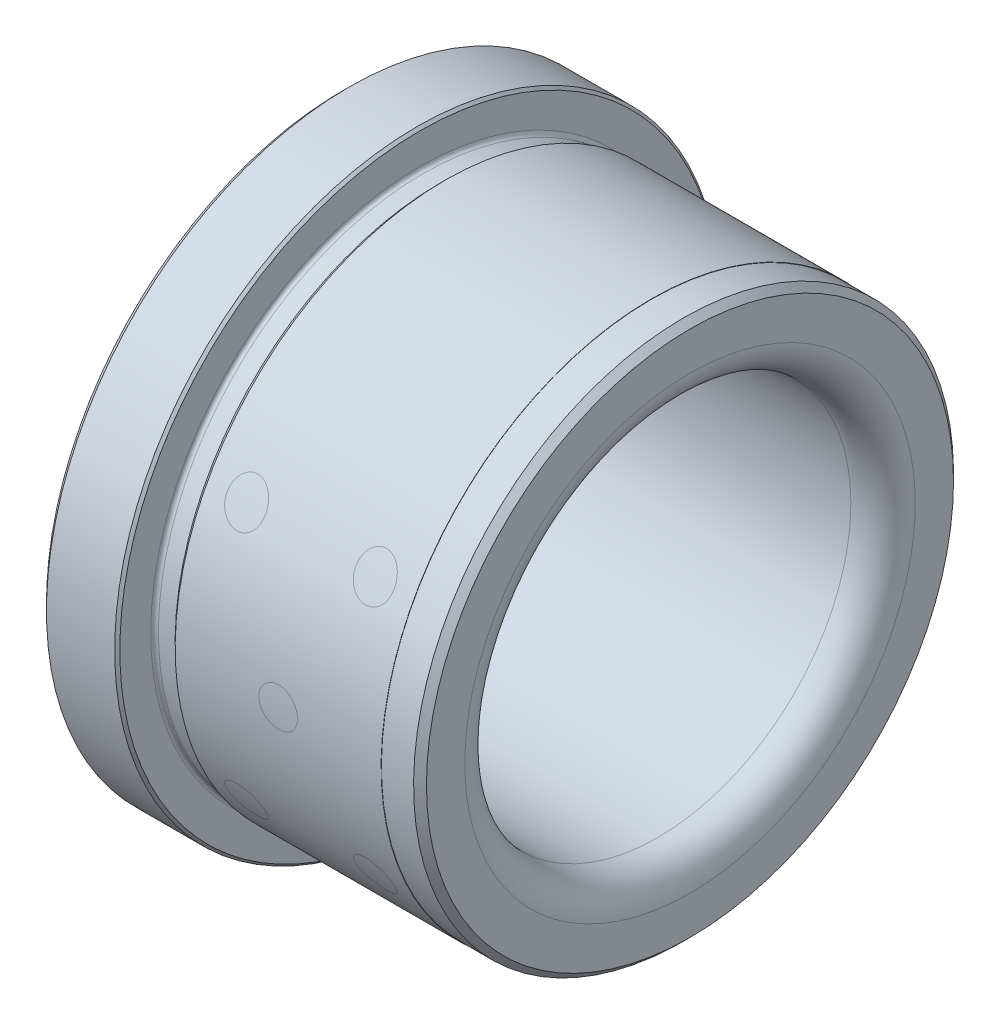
from build123d import *

# Parameters (mm, degrees)
SKETCH2_R      = 15
EXTRUDE1_DEPTH = 56
FILLET2_R      = 2.5
CHAMFER5_SIZE  = 0.2
CHAMFER3_SIZE  = 0.5
CHAMFER4_SIZE  = 0.5
CHAMFER7_SIZE  = 0.5


with BuildPart() as part:
    # Sketch1 → Revolve1 (revolve)
    with BuildSketch(Plane.XY):
        with BuildLine():
            Line((13.5, 20.975), (10.5, 20.975))
            Line((10.5, 20.975), (10.5, 21))
            Line((10.5, 21), (-5.5, 21))
            Line((-5.5, 21), (-5.9, 20.6))
            Line((-5.9, 20.6), (-7.2, 20.6))
            ThreePointArc((-7.2, 20.6), (-7.412132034, 20.687867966), (-7.5, 20.9))
            Line((-7.5, 20.9), (-7.5, 23.5))
            Line((-7.5, 23.5), (-13.5, 23.5))
            Line((-13.5, 23.5), (-13.5, 0))
            Line((-13.5, 0), (13.5, 0))
            Line((13.5, 0), (13.5, 20.975))
        make_face()
    revolve(axis=Axis((13.5, 0, 0), (-1, 0, 0)))

    # Sketch2 → Extrude1 (cut)
    with BuildSketch(Plane(origin=(13.5, 0, 0), x_dir=(0, 0, -1), z_dir=(1, 0, 0))):
        with Locations(Location((0, 0, 0), (0, 0, 90))):
            Circle(SKETCH2_R)
    extrude(amount=-EXTRUDE1_DEPTH, mode=Mode.SUBTRACT)

    # Fillet2
    fillet2_edges = [part.edges().sort_by_distance(p)[0] for p in [
        (13.5, -15, 0),
    ]]
    fillet(fillet2_edges, radius=FILLET2_R)

    # Chamfer5
    chamfer5_edges = [part.edges().sort_by_distance(p)[0] for p in [
        (-7.5, -23.5, 0),
    ]]
    chamfer(chamfer5_edges, length=CHAMFER5_SIZE)

    # Chamfer3
    chamfer3_edges = [part.edges().sort_by_distance(p)[0] for p in [
        (13.5, -20.975, 0),
    ]]
    chamfer(chamfer3_edges, length=CHAMFER3_SIZE)

    # Chamfer4
    chamfer4_edges = [part.edges().sort_by_distance(p)[0] for p in [
        (-13.5, -23.5, 0),
    ]]
    chamfer(chamfer4_edges, length=CHAMFER4_SIZE)

    # Chamfer7
    chamfer7_edges = [part.edges().sort_by_distance(p)[0] for p in [
        (-13.5, -15, 0),
    ]]
    chamfer(chamfer7_edges, length=CHAMFER7_SIZE)


solid = part.part
